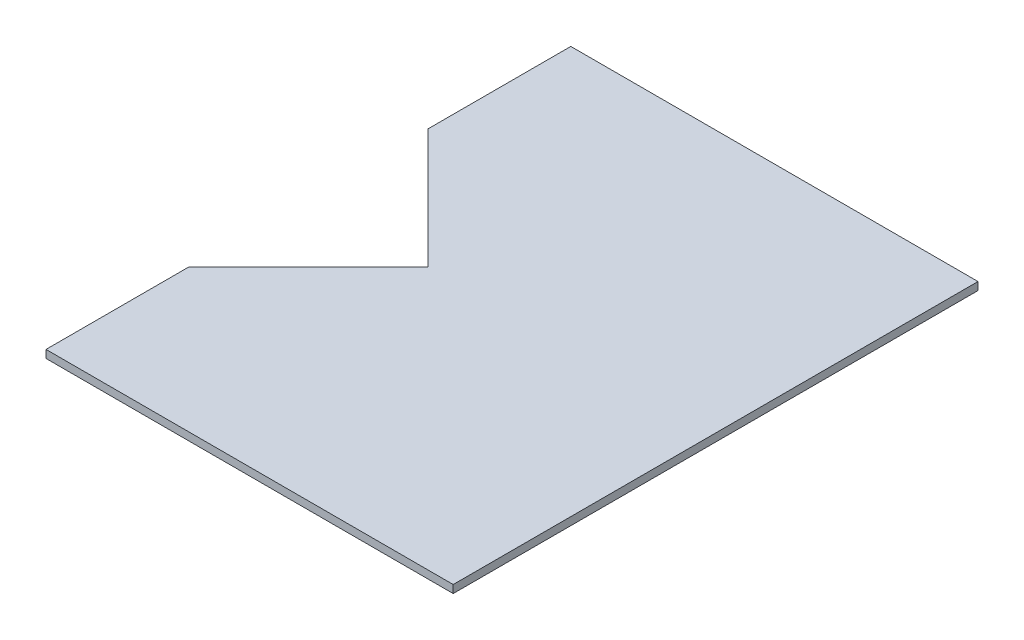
ISO-10303-21;
HEADER;
FILE_DESCRIPTION(('STEP AP214'),'2;1');
FILE_NAME('part.step','',(''),(''),'','','');
FILE_SCHEMA(('AUTOMOTIVE_DESIGN { 1 0 10303 214 1 1 1 1 }'));
ENDSEC;
DATA;
#1=APPLICATION_CONTEXT('core data for automotive mechanical design processes');
#2=APPLICATION_PROTOCOL_DEFINITION('international standard','automotive_design',2000,#1);
#3=PRODUCT_CONTEXT('',#1,'mechanical');
#4=PRODUCT('Part','Part','',(#3));
#5=PRODUCT_RELATED_PRODUCT_CATEGORY('part','',(#4));
#6=PRODUCT_DEFINITION_FORMATION('','',#4);
#7=PRODUCT_DEFINITION_CONTEXT('part definition',#1,'design');
#8=PRODUCT_DEFINITION('design','',#6,#7);
#9=PRODUCT_DEFINITION_SHAPE('','',#8);
#10=(LENGTH_UNIT() NAMED_UNIT(*) SI_UNIT(.MILLI.,.METRE.));
#11=(NAMED_UNIT(*) PLANE_ANGLE_UNIT() SI_UNIT($,.RADIAN.));
#12=(NAMED_UNIT(*) SI_UNIT($,.STERADIAN.) SOLID_ANGLE_UNIT());
#13=UNCERTAINTY_MEASURE_WITH_UNIT(LENGTH_MEASURE(1.E-05),#10,'distance_accuracy_value','');
#14=(GEOMETRIC_REPRESENTATION_CONTEXT(3) GLOBAL_UNCERTAINTY_ASSIGNED_CONTEXT((#13)) GLOBAL_UNIT_ASSIGNED_CONTEXT((#10,
#11,#12)) REPRESENTATION_CONTEXT('',''));
#15=CARTESIAN_POINT('',(0.,0.,0.));
#16=DIRECTION('',(0.,0.,1.));
#17=DIRECTION('',(1.,0.,0.));
#18=AXIS2_PLACEMENT_3D('',#15,#16,#17);
#19=CARTESIAN_POINT('',(0.,10.,0.));
#20=DIRECTION('',(-1.,0.,0.));
#21=DIRECTION('',(0.,0.,1.));
#22=AXIS2_PLACEMENT_3D('',#19,#20,#21);
#23=PLANE('',#22);
#24=DIRECTION('',(0.,1.,0.));
#25=VECTOR('',#24,1.);
#26=CARTESIAN_POINT('',(0.,10.,15.2356445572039));
#27=LINE('',#26,#25);
#28=CARTESIAN_POINT('',(0.,9.5,15.2356445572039));
#29=VERTEX_POINT('',#28);
#30=CARTESIAN_POINT('',(0.,10.5,15.2356445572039));
#31=VERTEX_POINT('',#30);
#32=EDGE_CURVE('E11',#29,#31,#27,.T.);
#33=ORIENTED_EDGE('',*,*,#32,.F.);
#34=DIRECTION('',(0.,0.,1.));
#35=VECTOR('',#34,1.);
#36=CARTESIAN_POINT('',(0.,9.5,0.));
#37=LINE('',#36,#35);
#38=CARTESIAN_POINT('',(0.,9.5,33.382140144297));
#39=VERTEX_POINT('',#38);
#40=EDGE_CURVE('E106',#39,#29,#37,.F.);
#41=ORIENTED_EDGE('',*,*,#40,.F.);
#42=DIRECTION('',(0.,1.,0.));
#43=VECTOR('',#42,1.);
#44=CARTESIAN_POINT('',(0.,10.,33.382140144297));
#45=LINE('',#44,#43);
#46=CARTESIAN_POINT('',(0.,10.5,33.382140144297));
#47=VERTEX_POINT('',#46);
#48=EDGE_CURVE('E42',#39,#47,#45,.T.);
#49=ORIENTED_EDGE('',*,*,#48,.T.);
#50=DIRECTION('',(0.,0.,1.));
#51=VECTOR('',#50,1.);
#52=CARTESIAN_POINT('',(0.,10.5,0.));
#53=LINE('',#52,#51);
#54=EDGE_CURVE('E134',#47,#31,#53,.F.);
#55=ORIENTED_EDGE('',*,*,#54,.T.);
#56=EDGE_LOOP('',(#33,#41,#49,#55));
#57=FACE_BOUND('',#56,.T.);
#58=ADVANCED_FACE('F32',(#57),#23,.T.);
#59=CARTESIAN_POINT('',(0.,10.,33.382140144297));
#60=DIRECTION('',(0.,0.,1.));
#61=DIRECTION('',(1.,0.,0.));
#62=AXIS2_PLACEMENT_3D('',#59,#60,#61);
#63=PLANE('',#62);
#64=ORIENTED_EDGE('',*,*,#48,.F.);
#65=DIRECTION('',(1.,0.,0.));
#66=VECTOR('',#65,1.);
#67=CARTESIAN_POINT('',(0.,9.5,33.382140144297));
#68=LINE('',#67,#66);
#69=CARTESIAN_POINT('',(51.8038208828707,9.5,33.382140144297));
#70=VERTEX_POINT('',#69);
#71=EDGE_CURVE('E122',#39,#70,#68,.T.);
#72=ORIENTED_EDGE('',*,*,#71,.T.);
#73=DIRECTION('',(0.,1.,0.));
#74=VECTOR('',#73,1.);
#75=CARTESIAN_POINT('',(51.8038208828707,10.,33.382140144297));
#76=LINE('',#75,#74);
#77=CARTESIAN_POINT('',(51.8038208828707,10.5,33.382140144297));
#78=VERTEX_POINT('',#77);
#79=EDGE_CURVE('E131',#70,#78,#76,.T.);
#80=ORIENTED_EDGE('',*,*,#79,.T.);
#81=DIRECTION('',(1.,0.,0.));
#82=VECTOR('',#81,1.);
#83=CARTESIAN_POINT('',(0.,10.5,33.382140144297));
#84=LINE('',#83,#82);
#85=EDGE_CURVE('E141',#47,#78,#84,.T.);
#86=ORIENTED_EDGE('',*,*,#85,.F.);
#87=EDGE_LOOP('',(#64,#72,#80,#86));
#88=FACE_BOUND('',#87,.T.);
#89=ADVANCED_FACE('F143',(#88),#63,.T.);
#90=CARTESIAN_POINT('',(51.8038208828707,10.,0.));
#91=DIRECTION('',(-1.,0.,0.));
#92=DIRECTION('',(0.,0.,1.));
#93=AXIS2_PLACEMENT_3D('',#90,#91,#92);
#94=PLANE('',#93);
#95=ORIENTED_EDGE('',*,*,#79,.F.);
#96=DIRECTION('',(0.,0.,1.));
#97=VECTOR('',#96,1.);
#98=CARTESIAN_POINT('',(51.8038208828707,9.5,0.));
#99=LINE('',#98,#97);
#100=CARTESIAN_POINT('',(51.8038208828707,9.5,-33.382140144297));
#101=VERTEX_POINT('',#100);
#102=EDGE_CURVE('E119',#70,#101,#99,.F.);
#103=ORIENTED_EDGE('',*,*,#102,.T.);
#104=DIRECTION('',(0.,1.,0.));
#105=VECTOR('',#104,1.);
#106=CARTESIAN_POINT('',(51.8038208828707,10.,-33.382140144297));
#107=LINE('',#106,#105);
#108=CARTESIAN_POINT('',(51.8038208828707,10.5,-33.382140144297));
#109=VERTEX_POINT('',#108);
#110=EDGE_CURVE('E129',#101,#109,#107,.T.);
#111=ORIENTED_EDGE('',*,*,#110,.T.);
#112=DIRECTION('',(0.,0.,1.));
#113=VECTOR('',#112,1.);
#114=CARTESIAN_POINT('',(51.8038208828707,10.5,0.));
#115=LINE('',#114,#113);
#116=EDGE_CURVE('E144',#78,#109,#115,.F.);
#117=ORIENTED_EDGE('',*,*,#116,.F.);
#118=EDGE_LOOP('',(#95,#103,#111,#117));
#119=FACE_BOUND('',#118,.T.);
#120=ADVANCED_FACE('F160',(#119),#94,.F.);
#121=CARTESIAN_POINT('',(0.,10.,-33.382140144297));
#122=DIRECTION('',(0.,0.,1.));
#123=DIRECTION('',(1.,0.,0.));
#124=AXIS2_PLACEMENT_3D('',#121,#122,#123);
#125=PLANE('',#124);
#126=ORIENTED_EDGE('',*,*,#110,.F.);
#127=DIRECTION('',(1.,0.,0.));
#128=VECTOR('',#127,1.);
#129=CARTESIAN_POINT('',(0.,9.5,-33.382140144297));
#130=LINE('',#129,#128);
#131=CARTESIAN_POINT('',(0.,9.5,-33.382140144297));
#132=VERTEX_POINT('',#131);
#133=EDGE_CURVE('E116',#101,#132,#130,.F.);
#134=ORIENTED_EDGE('',*,*,#133,.T.);
#135=DIRECTION('',(0.,1.,0.));
#136=VECTOR('',#135,1.);
#137=CARTESIAN_POINT('',(0.,10.,-33.382140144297));
#138=LINE('',#137,#136);
#139=CARTESIAN_POINT('',(0.,10.5,-33.382140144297));
#140=VERTEX_POINT('',#139);
#141=EDGE_CURVE('E127',#132,#140,#138,.T.);
#142=ORIENTED_EDGE('',*,*,#141,.T.);
#143=DIRECTION('',(1.,0.,0.));
#144=VECTOR('',#143,1.);
#145=CARTESIAN_POINT('',(0.,10.5,-33.382140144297));
#146=LINE('',#145,#144);
#147=EDGE_CURVE('E146',#109,#140,#146,.F.);
#148=ORIENTED_EDGE('',*,*,#147,.F.);
#149=EDGE_LOOP('',(#126,#134,#142,#148));
#150=FACE_BOUND('',#149,.T.);
#151=ADVANCED_FACE('F157',(#150),#125,.F.);
#152=CARTESIAN_POINT('',(0.,10.,0.));
#153=DIRECTION('',(-1.,0.,0.));
#154=DIRECTION('',(0.,0.,1.));
#155=AXIS2_PLACEMENT_3D('',#152,#153,#154);
#156=PLANE('',#155);
#157=ORIENTED_EDGE('',*,*,#141,.F.);
#158=DIRECTION('',(0.,0.,1.));
#159=VECTOR('',#158,1.);
#160=CARTESIAN_POINT('',(0.,9.5,0.));
#161=LINE('',#160,#159);
#162=CARTESIAN_POINT('',(0.,9.5,-15.2356445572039));
#163=VERTEX_POINT('',#162);
#164=EDGE_CURVE('E113',#163,#132,#161,.F.);
#165=ORIENTED_EDGE('',*,*,#164,.F.);
#166=DIRECTION('',(0.,1.,0.));
#167=VECTOR('',#166,1.);
#168=CARTESIAN_POINT('',(0.,10.,-15.2356445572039));
#169=LINE('',#168,#167);
#170=CARTESIAN_POINT('',(0.,10.5,-15.2356445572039));
#171=VERTEX_POINT('',#170);
#172=EDGE_CURVE('E50',#163,#171,#169,.T.);
#173=ORIENTED_EDGE('',*,*,#172,.T.);
#174=DIRECTION('',(0.,0.,1.));
#175=VECTOR('',#174,1.);
#176=CARTESIAN_POINT('',(0.,10.5,0.));
#177=LINE('',#176,#175);
#178=EDGE_CURVE('E99',#171,#140,#177,.F.);
#179=ORIENTED_EDGE('',*,*,#178,.T.);
#180=EDGE_LOOP('',(#157,#165,#173,#179));
#181=FACE_BOUND('',#180,.T.);
#182=ADVANCED_FACE('F154',(#181),#156,.T.);
#183=CARTESIAN_POINT('',(7.61782227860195,10.,-7.61782227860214));
#184=DIRECTION('',(-0.707106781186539,0.,0.707106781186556));
#185=DIRECTION('',(0.707106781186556,0.,0.707106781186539));
#186=AXIS2_PLACEMENT_3D('',#183,#184,#185);
#187=PLANE('',#186);
#188=ORIENTED_EDGE('',*,*,#172,.F.);
#189=DIRECTION('',(0.707106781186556,0.,0.707106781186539));
#190=VECTOR('',#189,1.);
#191=CARTESIAN_POINT('',(7.61782227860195,9.5,-7.61782227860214));
#192=LINE('',#191,#190);
#193=CARTESIAN_POINT('',(15.2356445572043,9.5,0.));
#194=VERTEX_POINT('',#193);
#195=EDGE_CURVE('E104',#163,#194,#192,.T.);
#196=ORIENTED_EDGE('',*,*,#195,.T.);
#197=DIRECTION('',(0.,1.,0.));
#198=VECTOR('',#197,1.);
#199=CARTESIAN_POINT('',(15.2356445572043,10.,0.));
#200=LINE('',#199,#198);
#201=CARTESIAN_POINT('',(15.2356445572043,10.5,0.));
#202=VERTEX_POINT('',#201);
#203=EDGE_CURVE('E36',#194,#202,#200,.T.);
#204=ORIENTED_EDGE('',*,*,#203,.T.);
#205=DIRECTION('',(0.707106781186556,0.,0.707106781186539));
#206=VECTOR('',#205,1.);
#207=CARTESIAN_POINT('',(7.61782227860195,10.5,-7.61782227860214));
#208=LINE('',#207,#206);
#209=EDGE_CURVE('E115',#171,#202,#208,.T.);
#210=ORIENTED_EDGE('',*,*,#209,.F.);
#211=EDGE_LOOP('',(#188,#196,#204,#210));
#212=FACE_BOUND('',#211,.T.);
#213=ADVANCED_FACE('F108',(#212),#187,.T.);
#214=CARTESIAN_POINT('',(7.61782227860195,10.,7.61782227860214));
#215=DIRECTION('',(-0.707106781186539,0.,-0.707106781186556));
#216=DIRECTION('',(-0.707106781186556,0.,0.707106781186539));
#217=AXIS2_PLACEMENT_3D('',#214,#215,#216);
#218=PLANE('',#217);
#219=DIRECTION('',(-0.707106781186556,0.,0.707106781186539));
#220=VECTOR('',#219,1.);
#221=CARTESIAN_POINT('',(7.61782227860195,9.5,7.61782227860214));
#222=LINE('',#221,#220);
#223=EDGE_CURVE('E93',#194,#29,#222,.T.);
#224=ORIENTED_EDGE('',*,*,#223,.T.);
#225=ORIENTED_EDGE('',*,*,#32,.T.);
#226=DIRECTION('',(-0.707106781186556,0.,0.707106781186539));
#227=VECTOR('',#226,1.);
#228=CARTESIAN_POINT('',(7.61782227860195,10.5,7.61782227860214));
#229=LINE('',#228,#227);
#230=EDGE_CURVE('E95',#202,#31,#229,.T.);
#231=ORIENTED_EDGE('',*,*,#230,.F.);
#232=ORIENTED_EDGE('',*,*,#203,.F.);
#233=EDGE_LOOP('',(#224,#225,#231,#232));
#234=FACE_BOUND('',#233,.T.);
#235=ADVANCED_FACE('F34',(#234),#218,.T.);
#236=CARTESIAN_POINT('',(0.,10.5,0.));
#237=DIRECTION('',(0.,1.,0.));
#238=DIRECTION('',(0.,0.,1.));
#239=AXIS2_PLACEMENT_3D('',#236,#237,#238);
#240=PLANE('',#239);
#241=ORIENTED_EDGE('',*,*,#209,.T.);
#242=ORIENTED_EDGE('',*,*,#230,.T.);
#243=ORIENTED_EDGE('',*,*,#54,.F.);
#244=ORIENTED_EDGE('',*,*,#85,.T.);
#245=ORIENTED_EDGE('',*,*,#116,.T.);
#246=ORIENTED_EDGE('',*,*,#147,.T.);
#247=ORIENTED_EDGE('',*,*,#178,.F.);
#248=EDGE_LOOP('',(#241,#242,#243,#244,#245,#246,#247));
#249=FACE_BOUND('',#248,.T.);
#250=ADVANCED_FACE('F139',(#249),#240,.T.);
#251=CARTESIAN_POINT('',(0.,9.5,0.));
#252=DIRECTION('',(0.,1.,0.));
#253=DIRECTION('',(0.,0.,1.));
#254=AXIS2_PLACEMENT_3D('',#251,#252,#253);
#255=PLANE('',#254);
#256=ORIENTED_EDGE('',*,*,#195,.F.);
#257=ORIENTED_EDGE('',*,*,#164,.T.);
#258=ORIENTED_EDGE('',*,*,#133,.F.);
#259=ORIENTED_EDGE('',*,*,#102,.F.);
#260=ORIENTED_EDGE('',*,*,#71,.F.);
#261=ORIENTED_EDGE('',*,*,#40,.T.);
#262=ORIENTED_EDGE('',*,*,#223,.F.);
#263=EDGE_LOOP('',(#256,#257,#258,#259,#260,#261,#262));
#264=FACE_BOUND('',#263,.T.);
#265=ADVANCED_FACE('F102',(#264),#255,.F.);
#266=CLOSED_SHELL('',(#58,#89,#120,#151,#182,#213,#235,#250,#265));
#267=MANIFOLD_SOLID_BREP('B2',#266);
#268=ADVANCED_BREP_SHAPE_REPRESENTATION('',(#18,#267),#14);
#269=SHAPE_DEFINITION_REPRESENTATION(#9,#268);
ENDSEC;
END-ISO-10303-21;
